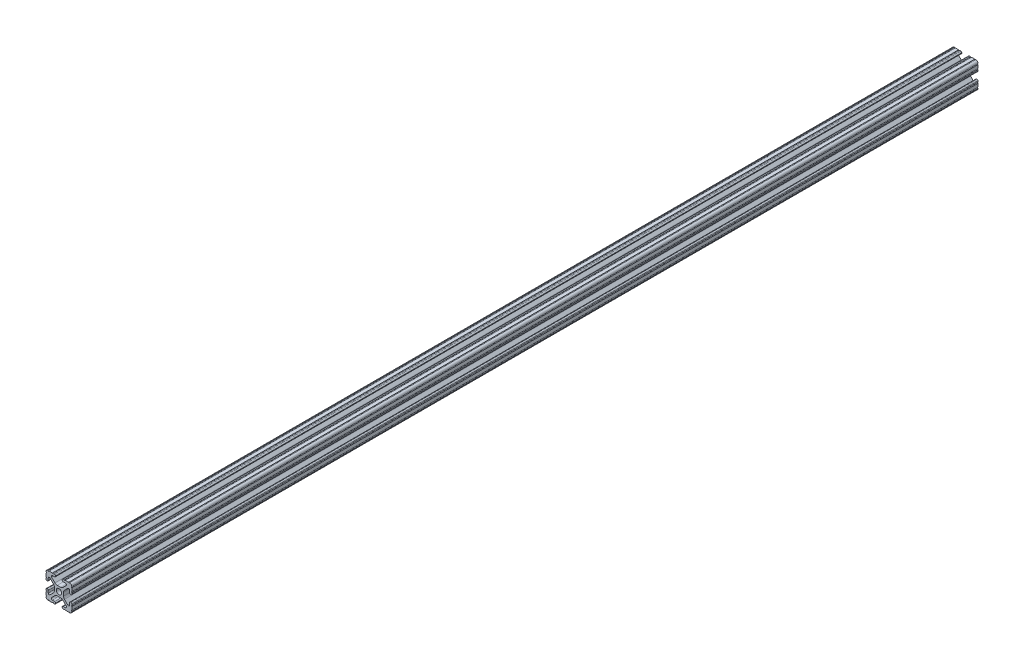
from build123d import *

# Parameters (mm, degrees)
SKETCH1_R           = 2.6035
BOSS_EXTRUDE1_DEPTH = 891.1082


with BuildPart() as part:
    # Sketch1 → Boss-Extrude1 (new body)
    with BuildSketch(Plane.XY):
        with BuildLine():
            Line((-7.179650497, -8.645192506), (-3.952270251, -5.423690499))
            ThreePointArc((-3.952270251, -5.423690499), (-2.922936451, -4.736929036), (-1.709253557, -4.4958))
            Line((-1.709253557, -4.4958), (1.709253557, -4.4958))
            ThreePointArc((1.709253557, -4.4958), (2.922936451, -4.736929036), (3.952270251, -5.423690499))
            Line((3.952270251, -5.423690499), (7.179650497, -8.645192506))
            ThreePointArc((7.179650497, -8.645192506), (7.41473083, -9.822813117), (6.416408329, -10.4902))
            Line((6.416408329, -10.4902), (4.287512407, -10.4902))
            ThreePointArc((4.287512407, -10.4902), (3.54574862, -10.79744862), (3.2385, -11.539212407))
            Line((3.2385, -11.539212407), (3.2385, -11.650987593))
            ThreePointArc((3.2385, -11.650987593), (3.54574862, -12.39275138), (4.287512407, -12.7))
            Line((4.287512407, -12.7), (5.317126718, -12.7))
            ThreePointArc((5.317126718, -12.7), (5.825126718, -12.192), (6.333126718, -12.7))
            Line((6.333126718, -12.7), (9.550443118, -12.7))
            ThreePointArc((9.550443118, -12.7), (10.058366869, -12.192000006), (10.566443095, -12.699847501))
            ThreePointArc((10.566443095, -12.699847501), (12.082537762, -12.08250727), (12.699846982, -10.566399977))
            ThreePointArc((12.699846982, -10.566399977), (12.192000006, -10.058323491), (12.7, -9.5504))
            Line((12.7, -9.5504), (12.7, -6.3330836))
            ThreePointArc((12.7, -6.3330836), (12.192, -5.8250836), (12.7, -5.3170836))
            Line((12.7, -5.3170836), (12.7, -4.287469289))
            ThreePointArc((12.7, -4.287469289), (12.39275138, -3.545705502), (11.650987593, -3.238456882))
            Line((11.650987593, -3.238456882), (11.539212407, -3.238456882))
            ThreePointArc((11.539212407, -3.238456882), (10.79744862, -3.545705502), (10.4902, -4.287469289))
            Line((10.4902, -4.287469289), (10.4902, -6.402089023))
            ThreePointArc((10.4902, -6.402089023), (9.856505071, -7.351067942), (8.737131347, -7.129408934))
            Line((8.737131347, -7.129408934), (5.441005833, -3.840816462))
            ThreePointArc((5.441005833, -3.840816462), (4.750877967, -2.809883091), (4.5085, -1.593185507))
            Line((4.5085, -1.593185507), (4.5085, 1.593185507))
            ThreePointArc((4.5085, 1.593185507), (4.750877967, 2.809883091), (5.441005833, 3.840816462))
            Line((5.441005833, 3.840816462), (8.737131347, 7.129408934))
            ThreePointArc((8.737131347, 7.129408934), (9.856505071, 7.351067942), (10.4902, 6.402089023))
            Line((10.4902, 6.402089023), (10.4902, 4.287469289))
            ThreePointArc((10.4902, 4.287469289), (10.79744862, 3.545705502), (11.539212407, 3.238456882))
            Line((11.539212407, 3.238456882), (11.650987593, 3.238456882))
            ThreePointArc((11.650987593, 3.238456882), (12.39275138, 3.545705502), (12.7, 4.287469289))
            Line((12.7, 4.287469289), (12.7, 5.3170836))
            ThreePointArc((12.7, 5.3170836), (12.192, 5.8250836), (12.7, 6.3330836))
            Line((12.7, 6.3330836), (12.7, 9.5504))
            ThreePointArc((12.7, 9.5504), (12.192000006, 10.058323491), (12.699846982, 10.566399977))
            ThreePointArc((12.699846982, 10.566399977), (12.082537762, 12.08250727), (10.566443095, 12.699847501))
            ThreePointArc((10.566443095, 12.699847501), (10.058366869, 12.192000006), (9.550443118, 12.7))
            Line((9.550443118, 12.7), (6.333126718, 12.7))
            ThreePointArc((6.333126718, 12.7), (5.825126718, 12.192), (5.317126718, 12.7))
            Line((5.317126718, 12.7), (4.287512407, 12.7))
            ThreePointArc((4.287512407, 12.7), (3.54574862, 12.39275138), (3.2385, 11.650987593))
            Line((3.2385, 11.650987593), (3.2385, 11.539212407))
            ThreePointArc((3.2385, 11.539212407), (3.54574862, 10.79744862), (4.287512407, 10.4902))
            Line((4.287512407, 10.4902), (6.476788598, 10.4902))
            ThreePointArc((6.476788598, 10.4902), (7.432222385, 9.85140422), (7.207036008, 8.724370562))
            Line((7.207036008, 8.724370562), (3.898272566, 5.423169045))
            ThreePointArc((3.898272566, 5.423169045), (2.869120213, 4.736787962), (1.655778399, 4.4958))
            Line((1.655778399, 4.4958), (-1.655778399, 4.4958))
            ThreePointArc((-1.655778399, 4.4958), (-2.869120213, 4.736787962), (-3.898272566, 5.423169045))
            Line((-3.898272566, 5.423169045), (-7.207036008, 8.724370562))
            ThreePointArc((-7.207036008, 8.724370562), (-7.432222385, 9.85140422), (-6.476788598, 10.4902))
            Line((-6.476788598, 10.4902), (-4.287512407, 10.4902))
            ThreePointArc((-4.287512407, 10.4902), (-3.54574862, 10.79744862), (-3.2385, 11.539212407))
            Line((-3.2385, 11.539212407), (-3.2385, 11.650987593))
            ThreePointArc((-3.2385, 11.650987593), (-3.54574862, 12.39275138), (-4.287512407, 12.7))
            Line((-4.287512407, 12.7), (-5.317126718, 12.7))
            ThreePointArc((-5.317126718, 12.7), (-5.825126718, 12.192), (-6.333126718, 12.7))
            Line((-6.333126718, 12.7), (-9.550443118, 12.7))
            ThreePointArc((-9.550443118, 12.7), (-10.058366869, 12.192000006), (-10.566443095, 12.699847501))
            ThreePointArc((-10.566443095, 12.699847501), (-12.082537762, 12.08250727), (-12.699846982, 10.566399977))
            ThreePointArc((-12.699846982, 10.566399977), (-12.192000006, 10.058323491), (-12.7, 9.5504))
            Line((-12.7, 9.5504), (-12.7, 6.3330836))
            ThreePointArc((-12.7, 6.3330836), (-12.192, 5.8250836), (-12.7, 5.3170836))
            Line((-12.7, 5.3170836), (-12.7, 4.287469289))
            ThreePointArc((-12.7, 4.287469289), (-12.39275138, 3.545705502), (-11.650987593, 3.238456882))
            Line((-11.650987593, 3.238456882), (-11.539212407, 3.238456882))
            ThreePointArc((-11.539212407, 3.238456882), (-10.79744862, 3.545705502), (-10.4902, 4.287469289))
            Line((-10.4902, 4.287469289), (-10.4902, 6.402089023))
            ThreePointArc((-10.4902, 6.402089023), (-9.856505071, 7.351067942), (-8.737131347, 7.129408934))
            Line((-8.737131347, 7.129408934), (-5.441005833, 3.840816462))
            ThreePointArc((-5.441005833, 3.840816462), (-4.750877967, 2.809883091), (-4.5085, 1.593185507))
            Line((-4.5085, 1.593185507), (-4.5085, -1.593185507))
            ThreePointArc((-4.5085, -1.593185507), (-4.750877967, -2.809883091), (-5.441005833, -3.840816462))
            Line((-5.441005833, -3.840816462), (-8.737131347, -7.129408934))
            ThreePointArc((-8.737131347, -7.129408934), (-9.856505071, -7.351067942), (-10.4902, -6.402089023))
            Line((-10.4902, -6.402089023), (-10.4902, -4.287469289))
            ThreePointArc((-10.4902, -4.287469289), (-10.79744862, -3.545705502), (-11.539212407, -3.238456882))
            Line((-11.539212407, -3.238456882), (-11.650987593, -3.238456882))
            ThreePointArc((-11.650987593, -3.238456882), (-12.39275138, -3.545705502), (-12.7, -4.287469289))
            Line((-12.7, -4.287469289), (-12.7, -5.3170836))
            ThreePointArc((-12.7, -5.3170836), (-12.192, -5.8250836), (-12.7, -6.3330836))
            Line((-12.7, -6.3330836), (-12.7, -9.5504))
            ThreePointArc((-12.7, -9.5504), (-12.192000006, -10.058323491), (-12.699846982, -10.566399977))
            ThreePointArc((-12.699846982, -10.566399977), (-12.082537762, -12.08250727), (-10.566443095, -12.699847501))
            ThreePointArc((-10.566443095, -12.699847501), (-10.058366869, -12.192000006), (-9.550443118, -12.7))
            Line((-9.550443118, -12.7), (-6.333126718, -12.7))
            ThreePointArc((-6.333126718, -12.7), (-5.825126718, -12.192), (-5.317126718, -12.7))
            Line((-5.317126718, -12.7), (-4.287512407, -12.7))
            ThreePointArc((-4.287512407, -12.7), (-3.54574862, -12.39275138), (-3.2385, -11.650987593))
            Line((-3.2385, -11.650987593), (-3.2385, -11.539212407))
            ThreePointArc((-3.2385, -11.539212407), (-3.54574862, -10.79744862), (-4.287512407, -10.4902))
            Line((-4.287512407, -10.4902), (-6.416408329, -10.4902))
            ThreePointArc((-6.416408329, -10.4902), (-7.41473083, -9.822813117), (-7.179650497, -8.645192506))
        make_face()
        with Locations(Location((0, 0, 0), (0, 0, 270))):
            Circle(SKETCH1_R, mode=Mode.SUBTRACT)
    extrude(amount=BOSS_EXTRUDE1_DEPTH)


solid = part.part
